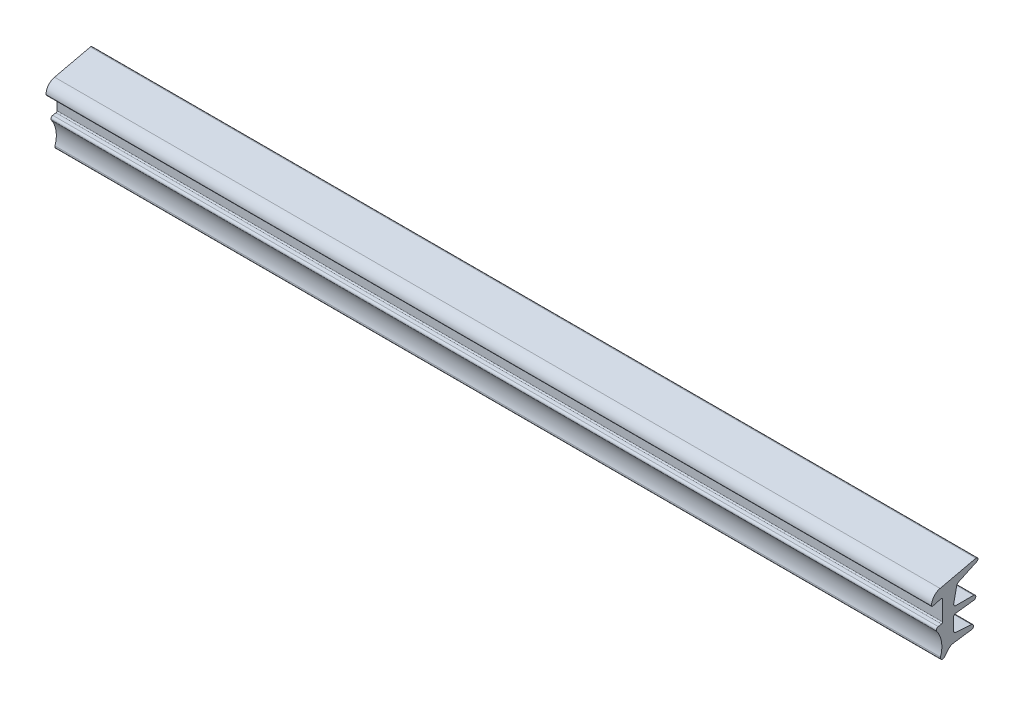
ISO-10303-21;
HEADER;
FILE_DESCRIPTION(('STEP AP214'),'2;1');
FILE_NAME('part.step','',(''),(''),'','','');
FILE_SCHEMA(('AUTOMOTIVE_DESIGN { 1 0 10303 214 1 1 1 1 }'));
ENDSEC;
DATA;
#1=APPLICATION_CONTEXT('core data for automotive mechanical design processes');
#2=APPLICATION_PROTOCOL_DEFINITION('international standard','automotive_design',2000,#1);
#3=PRODUCT_CONTEXT('',#1,'mechanical');
#4=PRODUCT('Part','Part','',(#3));
#5=PRODUCT_RELATED_PRODUCT_CATEGORY('part','',(#4));
#6=PRODUCT_DEFINITION_FORMATION('','',#4);
#7=PRODUCT_DEFINITION_CONTEXT('part definition',#1,'design');
#8=PRODUCT_DEFINITION('design','',#6,#7);
#9=PRODUCT_DEFINITION_SHAPE('','',#8);
#10=(LENGTH_UNIT() NAMED_UNIT(*) SI_UNIT(.MILLI.,.METRE.));
#11=(NAMED_UNIT(*) PLANE_ANGLE_UNIT() SI_UNIT($,.RADIAN.));
#12=(NAMED_UNIT(*) SI_UNIT($,.STERADIAN.) SOLID_ANGLE_UNIT());
#13=UNCERTAINTY_MEASURE_WITH_UNIT(LENGTH_MEASURE(1.E-05),#10,'distance_accuracy_value','');
#14=(GEOMETRIC_REPRESENTATION_CONTEXT(3) GLOBAL_UNCERTAINTY_ASSIGNED_CONTEXT((#13)) GLOBAL_UNIT_ASSIGNED_CONTEXT((#10,
#11,#12)) REPRESENTATION_CONTEXT('',''));
#15=CARTESIAN_POINT('',(0.,0.,0.));
#16=DIRECTION('',(0.,0.,1.));
#17=DIRECTION('',(1.,0.,0.));
#18=AXIS2_PLACEMENT_3D('',#15,#16,#17);
#19=CARTESIAN_POINT('',(200.,3.85279327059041,-2.80191835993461));
#20=DIRECTION('',(-1.,0.,0.));
#21=DIRECTION('',(0.,0.,1.));
#22=AXIS2_PLACEMENT_3D('',#19,#20,#21);
#23=CYLINDRICAL_SURFACE('',#22,1.00000000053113);
#24=CARTESIAN_POINT('',(0.,3.85279327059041,-2.80191835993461));
#25=DIRECTION('',(-1.,0.,0.));
#26=DIRECTION('',(0.,0.,-1.));
#27=AXIS2_PLACEMENT_3D('',#24,#25,#26);
#28=CIRCLE('',#27,1.00000000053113);
#29=CARTESIAN_POINT('',(0.,4.06070496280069,-1.8237707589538));
#30=VERTEX_POINT('',#29);
#31=CARTESIAN_POINT('',(0.,4.75910105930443,-2.37930010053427));
#32=VERTEX_POINT('',#31);
#33=EDGE_CURVE('E363',#30,#32,#28,.T.);
#34=ORIENTED_EDGE('',*,*,#33,.T.);
#35=DIRECTION('',(-1.,0.,0.));
#36=VECTOR('',#35,1.);
#37=CARTESIAN_POINT('',(200.,4.75910105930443,-2.37930010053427));
#38=LINE('',#37,#36);
#39=CARTESIAN_POINT('',(200.,4.75910105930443,-2.37930010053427));
#40=VERTEX_POINT('',#39);
#41=EDGE_CURVE('E12',#40,#32,#38,.T.);
#42=ORIENTED_EDGE('',*,*,#41,.F.);
#43=CARTESIAN_POINT('',(200.,3.85279327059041,-2.80191835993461));
#44=DIRECTION('',(-1.,0.,0.));
#45=DIRECTION('',(0.,0.,-1.));
#46=AXIS2_PLACEMENT_3D('',#43,#44,#45);
#47=CIRCLE('',#46,1.00000000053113);
#48=CARTESIAN_POINT('',(200.,4.06070496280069,-1.8237707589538));
#49=VERTEX_POINT('',#48);
#50=EDGE_CURVE('E448',#49,#40,#47,.T.);
#51=ORIENTED_EDGE('',*,*,#50,.F.);
#52=DIRECTION('',(-1.,0.,0.));
#53=VECTOR('',#52,1.);
#54=CARTESIAN_POINT('',(200.,4.06070496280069,-1.8237707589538));
#55=LINE('',#54,#53);
#56=EDGE_CURVE('E359',#49,#30,#55,.T.);
#57=ORIENTED_EDGE('',*,*,#56,.T.);
#58=EDGE_LOOP('',(#34,#42,#51,#57));
#59=FACE_BOUND('',#58,.T.);
#60=ADVANCED_FACE('F136',(#59),#23,.F.);
#61=CARTESIAN_POINT('',(200.,4.75910105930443,-2.37930010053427));
#62=DIRECTION('',(0.,0.906307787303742,0.422618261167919));
#63=DIRECTION('',(0.,-0.422618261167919,0.906307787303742));
#64=AXIS2_PLACEMENT_3D('',#61,#62,#63);
#65=PLANE('',#64);
#66=DIRECTION('',(0.,0.422618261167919,-0.906307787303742));
#67=VECTOR('',#66,1.);
#68=CARTESIAN_POINT('',(0.,4.75910105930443,-2.37930010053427));
#69=LINE('',#68,#67);
#70=CARTESIAN_POINT('',(0.,6.65024621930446,-6.43487399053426));
#71=VERTEX_POINT('',#70);
#72=EDGE_CURVE('E367',#32,#71,#69,.T.);
#73=ORIENTED_EDGE('',*,*,#72,.T.);
#74=DIRECTION('',(-1.,0.,0.));
#75=VECTOR('',#74,1.);
#76=CARTESIAN_POINT('',(200.,6.65024621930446,-6.43487399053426));
#77=LINE('',#76,#75);
#78=CARTESIAN_POINT('',(200.,6.65024621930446,-6.43487399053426));
#79=VERTEX_POINT('',#78);
#80=EDGE_CURVE('E145',#79,#71,#77,.T.);
#81=ORIENTED_EDGE('',*,*,#80,.F.);
#82=DIRECTION('',(0.,0.422618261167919,-0.906307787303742));
#83=VECTOR('',#82,1.);
#84=CARTESIAN_POINT('',(200.,4.75910105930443,-2.37930010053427));
#85=LINE('',#84,#83);
#86=EDGE_CURVE('E259',#40,#79,#85,.T.);
#87=ORIENTED_EDGE('',*,*,#86,.F.);
#88=ORIENTED_EDGE('',*,*,#41,.T.);
#89=EDGE_LOOP('',(#73,#81,#87,#88));
#90=FACE_BOUND('',#89,.T.);
#91=ADVANCED_FACE('F661',(#90),#65,.F.);
#92=CARTESIAN_POINT('',(200.,7.01276932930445,-6.26582669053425));
#93=DIRECTION('',(-1.,0.,0.));
#94=DIRECTION('',(0.,0.,1.));
#95=AXIS2_PLACEMENT_3D('',#92,#93,#94);
#96=CYLINDRICAL_SURFACE('',#95,0.399999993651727);
#97=CARTESIAN_POINT('',(0.,7.01276932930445,-6.26582669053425));
#98=DIRECTION('',(1.,0.,0.));
#99=DIRECTION('',(0.,0.,-1.));
#100=AXIS2_PLACEMENT_3D('',#97,#98,#99);
#101=CIRCLE('',#100,0.399999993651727);
#102=CARTESIAN_POINT('',(0.,7.40251734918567,-6.17584627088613));
#103=VERTEX_POINT('',#102);
#104=EDGE_CURVE('E370',#71,#103,#101,.T.);
#105=ORIENTED_EDGE('',*,*,#104,.T.);
#106=DIRECTION('',(-1.,0.,0.));
#107=VECTOR('',#106,1.);
#108=CARTESIAN_POINT('',(200.,7.40251734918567,-6.17584627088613));
#109=LINE('',#108,#107);
#110=CARTESIAN_POINT('',(200.,7.40251734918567,-6.17584627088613));
#111=VERTEX_POINT('',#110);
#112=EDGE_CURVE('E543',#111,#103,#109,.T.);
#113=ORIENTED_EDGE('',*,*,#112,.F.);
#114=CARTESIAN_POINT('',(200.,7.01276932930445,-6.26582669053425));
#115=DIRECTION('',(1.,0.,0.));
#116=DIRECTION('',(0.,0.,-1.));
#117=AXIS2_PLACEMENT_3D('',#114,#115,#116);
#118=CIRCLE('',#117,0.399999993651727);
#119=EDGE_CURVE('E553',#79,#111,#118,.T.);
#120=ORIENTED_EDGE('',*,*,#119,.F.);
#121=ORIENTED_EDGE('',*,*,#80,.T.);
#122=EDGE_LOOP('',(#105,#113,#120,#121));
#123=FACE_BOUND('',#122,.T.);
#124=ADVANCED_FACE('F551',(#123),#96,.T.);
#125=CARTESIAN_POINT('',(200.,7.4025173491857,-6.17584627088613));
#126=DIRECTION('',(0.,-0.97437006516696,-0.224951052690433));
#127=DIRECTION('',(0.,0.224951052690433,-0.97437006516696));
#128=AXIS2_PLACEMENT_3D('',#125,#126,#127);
#129=PLANE('',#128);
#130=DIRECTION('',(0.,-0.224951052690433,0.97437006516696));
#131=VECTOR('',#130,1.);
#132=CARTESIAN_POINT('',(0.,7.4025173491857,-6.17584627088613));
#133=LINE('',#132,#131);
#134=CARTESIAN_POINT('',(0.,5.5388576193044,1.89655094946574));
#135=VERTEX_POINT('',#134);
#136=EDGE_CURVE('E373',#103,#135,#133,.T.);
#137=ORIENTED_EDGE('',*,*,#136,.T.);
#138=DIRECTION('',(-1.,0.,0.));
#139=VECTOR('',#138,1.);
#140=CARTESIAN_POINT('',(200.,5.5388576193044,1.89655094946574));
#141=LINE('',#140,#139);
#142=CARTESIAN_POINT('',(200.,5.5388576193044,1.89655094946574));
#143=VERTEX_POINT('',#142);
#144=EDGE_CURVE('E539',#143,#135,#141,.T.);
#145=ORIENTED_EDGE('',*,*,#144,.F.);
#146=DIRECTION('',(0.,-0.224951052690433,0.97437006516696));
#147=VECTOR('',#146,1.);
#148=CARTESIAN_POINT('',(200.,7.4025173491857,-6.17584627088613));
#149=LINE('',#148,#147);
#150=EDGE_CURVE('E572',#111,#143,#149,.T.);
#151=ORIENTED_EDGE('',*,*,#150,.F.);
#152=ORIENTED_EDGE('',*,*,#112,.T.);
#153=EDGE_LOOP('',(#137,#145,#151,#152));
#154=FACE_BOUND('',#153,.T.);
#155=ADVANCED_FACE('F562',(#154),#129,.F.);
#156=CARTESIAN_POINT('',(200.,3.10293245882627,1.33417330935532));
#157=DIRECTION('',(-1.,0.,0.));
#158=DIRECTION('',(0.,0.,1.));
#159=AXIS2_PLACEMENT_3D('',#156,#157,#158);
#160=CYLINDRICAL_SURFACE('',#159,2.49999999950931);
#161=CARTESIAN_POINT('',(0.,3.10293245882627,1.33417330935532));
#162=DIRECTION('',(1.,0.,0.));
#163=DIRECTION('',(0.,0.,-1.));
#164=AXIS2_PLACEMENT_3D('',#161,#162,#163);
#165=CIRCLE('',#164,2.49999999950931);
#166=CARTESIAN_POINT('',(0.,3.10293245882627,3.83417330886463));
#167=VERTEX_POINT('',#166);
#168=EDGE_CURVE('E376',#135,#167,#165,.T.);
#169=ORIENTED_EDGE('',*,*,#168,.T.);
#170=DIRECTION('',(-1.,0.,0.));
#171=VECTOR('',#170,1.);
#172=CARTESIAN_POINT('',(200.,3.10293245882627,3.83417330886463));
#173=LINE('',#172,#171);
#174=CARTESIAN_POINT('',(200.,3.10293245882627,3.83417330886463));
#175=VERTEX_POINT('',#174);
#176=EDGE_CURVE('E535',#175,#167,#173,.T.);
#177=ORIENTED_EDGE('',*,*,#176,.F.);
#178=CARTESIAN_POINT('',(200.,3.10293245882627,1.33417330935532));
#179=DIRECTION('',(1.,0.,0.));
#180=DIRECTION('',(0.,0.,-1.));
#181=AXIS2_PLACEMENT_3D('',#178,#179,#180);
#182=CIRCLE('',#181,2.49999999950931);
#183=EDGE_CURVE('E568',#143,#175,#182,.T.);
#184=ORIENTED_EDGE('',*,*,#183,.F.);
#185=ORIENTED_EDGE('',*,*,#144,.T.);
#186=EDGE_LOOP('',(#169,#177,#184,#185));
#187=FACE_BOUND('',#186,.T.);
#188=ADVANCED_FACE('F566',(#187),#160,.T.);
#189=CARTESIAN_POINT('',(200.,3.10293245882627,3.83417330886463));
#190=DIRECTION('',(0.,0.,-1.));
#191=DIRECTION('',(-1.,0.,0.));
#192=AXIS2_PLACEMENT_3D('',#189,#190,#191);
#193=PLANE('',#192);
#194=DIRECTION('',(0.,-1.,0.));
#195=VECTOR('',#194,1.);
#196=CARTESIAN_POINT('',(0.,3.10293245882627,3.83417330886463));
#197=LINE('',#196,#195);
#198=CARTESIAN_POINT('',(0.,3.09450903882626,3.83417330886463));
#199=VERTEX_POINT('',#198);
#200=EDGE_CURVE('E379',#167,#199,#197,.T.);
#201=ORIENTED_EDGE('',*,*,#200,.T.);
#202=DIRECTION('',(-1.,0.,0.));
#203=VECTOR('',#202,1.);
#204=CARTESIAN_POINT('',(200.,3.09450903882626,3.83417330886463));
#205=LINE('',#204,#203);
#206=CARTESIAN_POINT('',(200.,3.09450903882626,3.83417330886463));
#207=VERTEX_POINT('',#206);
#208=EDGE_CURVE('E531',#207,#199,#205,.T.);
#209=ORIENTED_EDGE('',*,*,#208,.F.);
#210=DIRECTION('',(0.,-1.,0.));
#211=VECTOR('',#210,1.);
#212=CARTESIAN_POINT('',(200.,3.10293245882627,3.83417330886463));
#213=LINE('',#212,#211);
#214=EDGE_CURVE('E571',#175,#207,#213,.T.);
#215=ORIENTED_EDGE('',*,*,#214,.F.);
#216=ORIENTED_EDGE('',*,*,#176,.T.);
#217=EDGE_LOOP('',(#201,#209,#215,#216));
#218=FACE_BOUND('',#217,.T.);
#219=ADVANCED_FACE('F674',(#218),#193,.F.);
#220=CARTESIAN_POINT('',(200.,3.09450903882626,3.63417330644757));
#221=DIRECTION('',(-1.,0.,0.));
#222=DIRECTION('',(0.,0.,1.));
#223=AXIS2_PLACEMENT_3D('',#220,#221,#222);
#224=CYLINDRICAL_SURFACE('',#223,0.200000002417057);
#225=CARTESIAN_POINT('',(0.,3.09450903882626,3.63417330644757));
#226=DIRECTION('',(1.,0.,0.));
#227=DIRECTION('',(0.,0.,-1.));
#228=AXIS2_PLACEMENT_3D('',#225,#226,#227);
#229=CIRCLE('',#228,0.200000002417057);
#230=CARTESIAN_POINT('',(0.,2.90132387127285,3.58240949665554));
#231=VERTEX_POINT('',#230);
#232=EDGE_CURVE('E382',#199,#231,#229,.T.);
#233=ORIENTED_EDGE('',*,*,#232,.T.);
#234=DIRECTION('',(-1.,0.,0.));
#235=VECTOR('',#234,1.);
#236=CARTESIAN_POINT('',(200.,2.90132387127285,3.58240949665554));
#237=LINE('',#236,#235);
#238=CARTESIAN_POINT('',(200.,2.90132387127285,3.58240949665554));
#239=VERTEX_POINT('',#238);
#240=EDGE_CURVE('E527',#239,#231,#237,.T.);
#241=ORIENTED_EDGE('',*,*,#240,.F.);
#242=CARTESIAN_POINT('',(200.,3.09450903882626,3.63417330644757));
#243=DIRECTION('',(1.,0.,0.));
#244=DIRECTION('',(0.,0.,-1.));
#245=AXIS2_PLACEMENT_3D('',#242,#243,#244);
#246=CIRCLE('',#245,0.200000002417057);
#247=EDGE_CURVE('E576',#207,#239,#246,.T.);
#248=ORIENTED_EDGE('',*,*,#247,.F.);
#249=ORIENTED_EDGE('',*,*,#208,.T.);
#250=EDGE_LOOP('',(#233,#241,#248,#249));
#251=FACE_BOUND('',#250,.T.);
#252=ADVANCED_FACE('F677',(#251),#224,.T.);
#253=CARTESIAN_POINT('',(200.,2.90132387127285,3.58240949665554));
#254=DIRECTION('',(0.,0.965925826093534,0.258819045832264));
#255=DIRECTION('',(0.,-0.258819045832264,0.965925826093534));
#256=AXIS2_PLACEMENT_3D('',#253,#254,#255);
#257=PLANE('',#256);
#258=DIRECTION('',(0.,0.258819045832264,-0.965925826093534));
#259=VECTOR('',#258,1.);
#260=CARTESIAN_POINT('',(0.,2.90132387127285,3.58240949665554));
#261=LINE('',#260,#259);
#262=CARTESIAN_POINT('',(0.,3.40254708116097,1.71181901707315));
#263=VERTEX_POINT('',#262);
#264=EDGE_CURVE('E385',#231,#263,#261,.T.);
#265=ORIENTED_EDGE('',*,*,#264,.T.);
#266=DIRECTION('',(-1.,0.,0.));
#267=VECTOR('',#266,1.);
#268=CARTESIAN_POINT('',(200.,3.40254708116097,1.71181901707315));
#269=LINE('',#268,#267);
#270=CARTESIAN_POINT('',(200.,3.40254708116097,1.71181901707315));
#271=VERTEX_POINT('',#270);
#272=EDGE_CURVE('E523',#271,#263,#269,.T.);
#273=ORIENTED_EDGE('',*,*,#272,.F.);
#274=DIRECTION('',(0.,0.258819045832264,-0.965925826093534));
#275=VECTOR('',#274,1.);
#276=CARTESIAN_POINT('',(200.,2.90132387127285,3.58240949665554));
#277=LINE('',#276,#275);
#278=EDGE_CURVE('E583',#239,#271,#277,.T.);
#279=ORIENTED_EDGE('',*,*,#278,.F.);
#280=ORIENTED_EDGE('',*,*,#240,.T.);
#281=EDGE_LOOP('',(#265,#273,#279,#280));
#282=FACE_BOUND('',#281,.T.);
#283=ADVANCED_FACE('F681',(#282),#257,.F.);
#284=CARTESIAN_POINT('',(200.,3.11276933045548,1.63417331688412));
#285=DIRECTION('',(-1.,0.,0.));
#286=DIRECTION('',(0.,0.,1.));
#287=AXIS2_PLACEMENT_3D('',#284,#285,#286);
#288=CYLINDRICAL_SURFACE('',#287,0.299999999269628);
#289=CARTESIAN_POINT('',(0.,3.11276933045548,1.63417331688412));
#290=DIRECTION('',(-1.,0.,0.));
#291=DIRECTION('',(0.,0.,-1.));
#292=AXIS2_PLACEMENT_3D('',#289,#290,#291);
#293=CIRCLE('',#292,0.299999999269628);
#294=CARTESIAN_POINT('',(0.,3.11276933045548,1.33417331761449));
#295=VERTEX_POINT('',#294);
#296=EDGE_CURVE('E388',#263,#295,#293,.T.);
#297=ORIENTED_EDGE('',*,*,#296,.T.);
#298=DIRECTION('',(-1.,0.,0.));
#299=VECTOR('',#298,1.);
#300=CARTESIAN_POINT('',(200.,3.11276933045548,1.33417331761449));
#301=LINE('',#300,#299);
#302=CARTESIAN_POINT('',(200.,3.11276933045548,1.33417331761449));
#303=VERTEX_POINT('',#302);
#304=EDGE_CURVE('E519',#303,#295,#301,.T.);
#305=ORIENTED_EDGE('',*,*,#304,.F.);
#306=CARTESIAN_POINT('',(200.,3.11276933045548,1.63417331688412));
#307=DIRECTION('',(-1.,0.,0.));
#308=DIRECTION('',(0.,0.,-1.));
#309=AXIS2_PLACEMENT_3D('',#306,#307,#308);
#310=CIRCLE('',#309,0.299999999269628);
#311=EDGE_CURVE('E586',#271,#303,#310,.T.);
#312=ORIENTED_EDGE('',*,*,#311,.F.);
#313=ORIENTED_EDGE('',*,*,#272,.T.);
#314=EDGE_LOOP('',(#297,#305,#312,#313));
#315=FACE_BOUND('',#314,.T.);
#316=ADVANCED_FACE('F685',(#315),#288,.F.);
#317=CARTESIAN_POINT('',(200.,3.11276933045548,1.33417331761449));
#318=DIRECTION('',(0.,0.,-1.));
#319=DIRECTION('',(-1.,0.,0.));
#320=AXIS2_PLACEMENT_3D('',#317,#318,#319);
#321=PLANE('',#320);
#322=DIRECTION('',(0.,-1.,0.));
#323=VECTOR('',#322,1.);
#324=CARTESIAN_POINT('',(0.,3.11276933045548,1.33417331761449));
#325=LINE('',#324,#323);
#326=CARTESIAN_POINT('',(0.,-1.28723067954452,1.33417331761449));
#327=VERTEX_POINT('',#326);
#328=EDGE_CURVE('E391',#295,#327,#325,.T.);
#329=ORIENTED_EDGE('',*,*,#328,.T.);
#330=DIRECTION('',(-1.,0.,0.));
#331=VECTOR('',#330,1.);
#332=CARTESIAN_POINT('',(200.,-1.28723067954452,1.33417331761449));
#333=LINE('',#332,#331);
#334=CARTESIAN_POINT('',(200.,-1.28723067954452,1.33417331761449));
#335=VERTEX_POINT('',#334);
#336=EDGE_CURVE('E515',#335,#327,#333,.T.);
#337=ORIENTED_EDGE('',*,*,#336,.F.);
#338=DIRECTION('',(0.,-1.,0.));
#339=VECTOR('',#338,1.);
#340=CARTESIAN_POINT('',(200.,3.11276933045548,1.33417331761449));
#341=LINE('',#340,#339);
#342=EDGE_CURVE('E589',#303,#335,#341,.T.);
#343=ORIENTED_EDGE('',*,*,#342,.F.);
#344=ORIENTED_EDGE('',*,*,#304,.T.);
#345=EDGE_LOOP('',(#329,#337,#343,#344));
#346=FACE_BOUND('',#345,.T.);
#347=ADVANCED_FACE('F689',(#346),#321,.F.);
#348=CARTESIAN_POINT('',(200.,-1.28723067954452,1.63417331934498));
#349=DIRECTION('',(-1.,0.,0.));
#350=DIRECTION('',(0.,0.,1.));
#351=AXIS2_PLACEMENT_3D('',#348,#349,#350);
#352=CYLINDRICAL_SURFACE('',#351,0.300000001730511);
#353=CARTESIAN_POINT('',(0.,-1.28723067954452,1.63417331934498));
#354=DIRECTION('',(-1.,0.,0.));
#355=DIRECTION('',(0.,0.,-1.));
#356=AXIS2_PLACEMENT_3D('',#353,#354,#355);
#357=CIRCLE('',#356,0.300000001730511);
#358=CARTESIAN_POINT('',(0.,-1.58267300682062,1.58207886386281));
#359=VERTEX_POINT('',#358);
#360=EDGE_CURVE('E394',#327,#359,#357,.T.);
#361=ORIENTED_EDGE('',*,*,#360,.T.);
#362=DIRECTION('',(-1.,0.,0.));
#363=VECTOR('',#362,1.);
#364=CARTESIAN_POINT('',(200.,-1.58267300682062,1.58207886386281));
#365=LINE('',#364,#363);
#366=CARTESIAN_POINT('',(200.,-1.58267300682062,1.58207886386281));
#367=VERTEX_POINT('',#366);
#368=EDGE_CURVE('E511',#367,#359,#365,.T.);
#369=ORIENTED_EDGE('',*,*,#368,.F.);
#370=CARTESIAN_POINT('',(200.,-1.28723067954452,1.63417331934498));
#371=DIRECTION('',(-1.,0.,0.));
#372=DIRECTION('',(0.,0.,-1.));
#373=AXIS2_PLACEMENT_3D('',#370,#371,#372);
#374=CIRCLE('',#373,0.300000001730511);
#375=EDGE_CURVE('E592',#335,#367,#374,.T.);
#376=ORIENTED_EDGE('',*,*,#375,.F.);
#377=ORIENTED_EDGE('',*,*,#336,.T.);
#378=EDGE_LOOP('',(#361,#369,#376,#377));
#379=FACE_BOUND('',#378,.T.);
#380=ADVANCED_FACE('F693',(#379),#352,.F.);
#381=CARTESIAN_POINT('',(200.,-1.58267300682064,1.58207886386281));
#382=DIRECTION('',(0.,-0.984807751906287,-0.173648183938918));
#383=DIRECTION('',(0.,0.173648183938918,-0.984807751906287));
#384=AXIS2_PLACEMENT_3D('',#381,#382,#383);
#385=PLANE('',#384);
#386=DIRECTION('',(0.,-0.173648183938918,0.984807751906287));
#387=VECTOR('',#386,1.);
#388=CARTESIAN_POINT('',(0.,-1.58267300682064,1.58207886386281));
#389=LINE('',#388,#387);
#390=CARTESIAN_POINT('',(0.,-1.71296428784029,2.32099740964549));
#391=VERTEX_POINT('',#390);
#392=EDGE_CURVE('E397',#359,#391,#389,.T.);
#393=ORIENTED_EDGE('',*,*,#392,.T.);
#394=DIRECTION('',(-1.,0.,0.));
#395=VECTOR('',#394,1.);
#396=CARTESIAN_POINT('',(200.,-1.71296428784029,2.32099740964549));
#397=LINE('',#396,#395);
#398=CARTESIAN_POINT('',(200.,-1.71296428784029,2.32099740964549));
#399=VERTEX_POINT('',#398);
#400=EDGE_CURVE('E507',#399,#391,#397,.T.);
#401=ORIENTED_EDGE('',*,*,#400,.F.);
#402=DIRECTION('',(0.,-0.173648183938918,0.984807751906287));
#403=VECTOR('',#402,1.);
#404=CARTESIAN_POINT('',(200.,-1.58267300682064,1.58207886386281));
#405=LINE('',#404,#403);
#406=EDGE_CURVE('E595',#367,#399,#405,.T.);
#407=ORIENTED_EDGE('',*,*,#406,.F.);
#408=ORIENTED_EDGE('',*,*,#368,.T.);
#409=EDGE_LOOP('',(#393,#401,#407,#408));
#410=FACE_BOUND('',#409,.T.);
#411=ADVANCED_FACE('F697',(#410),#385,.F.);
#412=CARTESIAN_POINT('',(200.,-2.20536816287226,2.23417332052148));
#413=DIRECTION('',(-1.,0.,0.));
#414=DIRECTION('',(0.,0.,1.));
#415=AXIS2_PLACEMENT_3D('',#412,#413,#414);
#416=CYLINDRICAL_SURFACE('',#415,0.499999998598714);
#417=CARTESIAN_POINT('',(0.,-2.20536816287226,2.23417332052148));
#418=DIRECTION('',(1.,0.,0.));
#419=DIRECTION('',(0.,0.,-1.));
#420=AXIS2_PLACEMENT_3D('',#417,#418,#419);
#421=CIRCLE('',#420,0.499999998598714);
#422=CARTESIAN_POINT('',(0.,-2.49215636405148,2.64374935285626));
#423=VERTEX_POINT('',#422);
#424=EDGE_CURVE('E400',#391,#423,#421,.T.);
#425=ORIENTED_EDGE('',*,*,#424,.T.);
#426=DIRECTION('',(-1.,0.,0.));
#427=VECTOR('',#426,1.);
#428=CARTESIAN_POINT('',(200.,-2.49215636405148,2.64374935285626));
#429=LINE('',#428,#427);
#430=CARTESIAN_POINT('',(200.,-2.49215636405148,2.64374935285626));
#431=VERTEX_POINT('',#430);
#432=EDGE_CURVE('E503',#431,#423,#429,.T.);
#433=ORIENTED_EDGE('',*,*,#432,.F.);
#434=CARTESIAN_POINT('',(200.,-2.20536816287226,2.23417332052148));
#435=DIRECTION('',(1.,0.,0.));
#436=DIRECTION('',(0.,0.,-1.));
#437=AXIS2_PLACEMENT_3D('',#434,#435,#436);
#438=CIRCLE('',#437,0.499999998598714);
#439=EDGE_CURVE('E598',#399,#431,#438,.T.);
#440=ORIENTED_EDGE('',*,*,#439,.F.);
#441=ORIENTED_EDGE('',*,*,#400,.T.);
#442=EDGE_LOOP('',(#425,#433,#440,#441));
#443=FACE_BOUND('',#442,.T.);
#444=ADVANCED_FACE('F701',(#443),#416,.T.);
#445=CARTESIAN_POINT('',(200.,-2.49215636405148,2.64374935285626));
#446=DIRECTION('',(0.,0.573576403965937,-0.819152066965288));
#447=DIRECTION('',(0.,0.819152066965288,0.573576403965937));
#448=AXIS2_PLACEMENT_3D('',#445,#446,#447);
#449=PLANE('',#448);
#450=DIRECTION('',(0.,-0.819152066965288,-0.573576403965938));
#451=VECTOR('',#450,1.);
#452=CARTESIAN_POINT('',(0.,-2.49215636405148,2.64374935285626));
#453=LINE('',#452,#451);
#454=CARTESIAN_POINT('',(0.,-2.57784203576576,2.58375160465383));
#455=VERTEX_POINT('',#454);
#456=EDGE_CURVE('E403',#423,#455,#453,.T.);
#457=ORIENTED_EDGE('',*,*,#456,.T.);
#458=DIRECTION('',(-1.,0.,0.));
#459=VECTOR('',#458,1.);
#460=CARTESIAN_POINT('',(200.,-2.57784203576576,2.58375160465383));
#461=LINE('',#460,#459);
#462=CARTESIAN_POINT('',(200.,-2.57784203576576,2.58375160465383));
#463=VERTEX_POINT('',#462);
#464=EDGE_CURVE('E499',#463,#455,#461,.T.);
#465=ORIENTED_EDGE('',*,*,#464,.F.);
#466=DIRECTION('',(0.,-0.819152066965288,-0.573576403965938));
#467=VECTOR('',#466,1.);
#468=CARTESIAN_POINT('',(200.,-2.49215636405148,2.64374935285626));
#469=LINE('',#468,#467);
#470=EDGE_CURVE('E601',#431,#463,#469,.T.);
#471=ORIENTED_EDGE('',*,*,#470,.F.);
#472=ORIENTED_EDGE('',*,*,#432,.T.);
#473=EDGE_LOOP('',(#457,#465,#471,#472));
#474=FACE_BOUND('',#473,.T.);
#475=ADVANCED_FACE('F705',(#474),#449,.F.);
#476=CARTESIAN_POINT('',(200.,-6.01930066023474,7.49866387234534));
#477=DIRECTION('',(-1.,0.,0.));
#478=DIRECTION('',(0.,0.,1.));
#479=AXIS2_PLACEMENT_3D('',#476,#477,#478);
#480=CYLINDRICAL_SURFACE('',#479,6.00000000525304);
#481=CARTESIAN_POINT('',(0.,-6.01930066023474,7.49866387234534));
#482=DIRECTION('',(-1.,0.,0.));
#483=DIRECTION('',(0.,0.,-1.));
#484=AXIS2_PLACEMENT_3D('',#481,#482,#483);
#485=CIRCLE('',#484,6.00000000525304);
#486=CARTESIAN_POINT('',(0.,-7.92810781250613,1.81039038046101));
#487=VERTEX_POINT('',#486);
#488=EDGE_CURVE('E406',#455,#487,#485,.T.);
#489=ORIENTED_EDGE('',*,*,#488,.T.);
#490=DIRECTION('',(-1.,0.,0.));
#491=VECTOR('',#490,1.);
#492=CARTESIAN_POINT('',(200.,-7.92810781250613,1.81039038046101));
#493=LINE('',#492,#491);
#494=CARTESIAN_POINT('',(200.,-7.92810781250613,1.81039038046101));
#495=VERTEX_POINT('',#494);
#496=EDGE_CURVE('E495',#495,#487,#493,.T.);
#497=ORIENTED_EDGE('',*,*,#496,.F.);
#498=CARTESIAN_POINT('',(200.,-6.01930066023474,7.49866387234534));
#499=DIRECTION('',(-1.,0.,0.));
#500=DIRECTION('',(0.,0.,-1.));
#501=AXIS2_PLACEMENT_3D('',#498,#499,#500);
#502=CIRCLE('',#501,6.00000000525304);
#503=EDGE_CURVE('E604',#463,#495,#502,.T.);
#504=ORIENTED_EDGE('',*,*,#503,.F.);
#505=ORIENTED_EDGE('',*,*,#464,.T.);
#506=EDGE_LOOP('',(#489,#497,#504,#505));
#507=FACE_BOUND('',#506,.T.);
#508=ADVANCED_FACE('F709',(#507),#480,.F.);
#509=CARTESIAN_POINT('',(200.,-8.08723068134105,1.33638625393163));
#510=DIRECTION('',(-1.,0.,0.));
#511=DIRECTION('',(0.,0.,1.));
#512=AXIS2_PLACEMENT_3D('',#509,#510,#511);
#513=CYLINDRICAL_SURFACE('',#512,0.499999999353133);
#514=CARTESIAN_POINT('',(0.,-8.08723068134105,1.33638625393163));
#515=DIRECTION('',(1.,0.,0.));
#516=DIRECTION('',(0.,0.,-1.));
#517=AXIS2_PLACEMENT_3D('',#514,#515,#516);
#518=CIRCLE('',#517,0.499999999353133);
#519=CARTESIAN_POINT('',(0.,-8.40862448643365,0.953364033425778));
#520=VERTEX_POINT('',#519);
#521=EDGE_CURVE('E409',#487,#520,#518,.T.);
#522=ORIENTED_EDGE('',*,*,#521,.T.);
#523=DIRECTION('',(-1.,0.,0.));
#524=VECTOR('',#523,1.);
#525=CARTESIAN_POINT('',(200.,-8.40862448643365,0.953364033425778));
#526=LINE('',#525,#524);
#527=CARTESIAN_POINT('',(200.,-8.40862448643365,0.953364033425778));
#528=VERTEX_POINT('',#527);
#529=EDGE_CURVE('E491',#528,#520,#526,.T.);
#530=ORIENTED_EDGE('',*,*,#529,.F.);
#531=CARTESIAN_POINT('',(200.,-8.08723068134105,1.33638625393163));
#532=DIRECTION('',(1.,0.,0.));
#533=DIRECTION('',(0.,0.,-1.));
#534=AXIS2_PLACEMENT_3D('',#531,#532,#533);
#535=CIRCLE('',#534,0.499999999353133);
#536=EDGE_CURVE('E607',#495,#528,#535,.T.);
#537=ORIENTED_EDGE('',*,*,#536,.F.);
#538=ORIENTED_EDGE('',*,*,#496,.T.);
#539=EDGE_LOOP('',(#522,#530,#537,#538));
#540=FACE_BOUND('',#539,.T.);
#541=ADVANCED_FACE('F713',(#540),#513,.T.);
#542=CARTESIAN_POINT('',(200.,-8.40862448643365,0.953364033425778));
#543=DIRECTION('',(0.,0.642787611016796,0.766044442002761));
#544=DIRECTION('',(0.,-0.76604444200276,0.642787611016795));
#545=AXIS2_PLACEMENT_3D('',#542,#543,#544);
#546=PLANE('',#545);
#547=DIRECTION('',(0.,0.766044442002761,-0.642787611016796));
#548=VECTOR('',#547,1.);
#549=CARTESIAN_POINT('',(0.,-8.40862448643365,0.953364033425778));
#550=LINE('',#549,#548);
#551=CARTESIAN_POINT('',(0.,-7.34553131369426,0.0613229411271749));
#552=VERTEX_POINT('',#551);
#553=EDGE_CURVE('E412',#520,#552,#550,.T.);
#554=ORIENTED_EDGE('',*,*,#553,.T.);
#555=DIRECTION('',(-1.,0.,0.));
#556=VECTOR('',#555,1.);
#557=CARTESIAN_POINT('',(200.,-7.34553131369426,0.0613229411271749));
#558=LINE('',#557,#556);
#559=CARTESIAN_POINT('',(200.,-7.34553131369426,0.0613229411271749));
#560=VERTEX_POINT('',#559);
#561=EDGE_CURVE('E487',#560,#552,#558,.T.);
#562=ORIENTED_EDGE('',*,*,#561,.F.);
#563=DIRECTION('',(0.,0.766044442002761,-0.642787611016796));
#564=VECTOR('',#563,1.);
#565=CARTESIAN_POINT('',(200.,-8.40862448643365,0.953364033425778));
#566=LINE('',#565,#564);
#567=EDGE_CURVE('E610',#528,#560,#566,.T.);
#568=ORIENTED_EDGE('',*,*,#567,.F.);
#569=ORIENTED_EDGE('',*,*,#529,.T.);
#570=EDGE_LOOP('',(#554,#562,#568,#569));
#571=FACE_BOUND('',#570,.T.);
#572=ADVANCED_FACE('F717',(#571),#546,.F.);
#573=CARTESIAN_POINT('',(200.,-8.63110656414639,-1.47076591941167));
#574=DIRECTION('',(-1.,0.,0.));
#575=DIRECTION('',(0.,0.,1.));
#576=AXIS2_PLACEMENT_3D('',#573,#574,#575);
#577=CYLINDRICAL_SURFACE('',#576,2.00000000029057);
#578=CARTESIAN_POINT('',(0.,-8.63110656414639,-1.47076591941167));
#579=DIRECTION('',(-1.,0.,0.));
#580=DIRECTION('',(0.,0.,-1.));
#581=AXIS2_PLACEMENT_3D('',#578,#579,#580);
#582=CIRCLE('',#581,2.00000000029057);
#583=CARTESIAN_POINT('',(0.,-6.65057042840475,-1.19241970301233));
#584=VERTEX_POINT('',#583);
#585=EDGE_CURVE('E415',#552,#584,#582,.T.);
#586=ORIENTED_EDGE('',*,*,#585,.T.);
#587=DIRECTION('',(-1.,0.,0.));
#588=VECTOR('',#587,1.);
#589=CARTESIAN_POINT('',(200.,-6.65057042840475,-1.19241970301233));
#590=LINE('',#589,#588);
#591=CARTESIAN_POINT('',(200.,-6.65057042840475,-1.19241970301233));
#592=VERTEX_POINT('',#591);
#593=EDGE_CURVE('E483',#592,#584,#590,.T.);
#594=ORIENTED_EDGE('',*,*,#593,.F.);
#595=CARTESIAN_POINT('',(200.,-8.63110656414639,-1.47076591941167));
#596=DIRECTION('',(-1.,0.,0.));
#597=DIRECTION('',(0.,0.,-1.));
#598=AXIS2_PLACEMENT_3D('',#595,#596,#597);
#599=CIRCLE('',#598,2.00000000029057);
#600=EDGE_CURVE('E613',#560,#592,#599,.T.);
#601=ORIENTED_EDGE('',*,*,#600,.F.);
#602=ORIENTED_EDGE('',*,*,#561,.T.);
#603=EDGE_LOOP('',(#586,#594,#601,#602));
#604=FACE_BOUND('',#603,.T.);
#605=ADVANCED_FACE('F721',(#604),#577,.F.);
#606=CARTESIAN_POINT('',(200.,-6.65057042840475,-1.19241970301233));
#607=DIRECTION('',(0.,0.990268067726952,0.139173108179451));
#608=DIRECTION('',(0.,-0.139173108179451,0.990268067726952));
#609=AXIS2_PLACEMENT_3D('',#606,#607,#608);
#610=PLANE('',#609);
#611=DIRECTION('',(0.,0.139173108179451,-0.990268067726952));
#612=VECTOR('',#611,1.);
#613=CARTESIAN_POINT('',(0.,-6.65057042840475,-1.19241970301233));
#614=LINE('',#613,#612);
#615=CARTESIAN_POINT('',(0.,-6.08236471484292,-5.23541321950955));
#616=VERTEX_POINT('',#615);
#617=EDGE_CURVE('E418',#584,#616,#614,.T.);
#618=ORIENTED_EDGE('',*,*,#617,.T.);
#619=DIRECTION('',(-1.,0.,0.));
#620=VECTOR('',#619,1.);
#621=CARTESIAN_POINT('',(200.,-6.08236471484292,-5.23541321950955));
#622=LINE('',#621,#620);
#623=CARTESIAN_POINT('',(200.,-6.08236471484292,-5.23541321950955));
#624=VERTEX_POINT('',#623);
#625=EDGE_CURVE('E479',#624,#616,#622,.T.);
#626=ORIENTED_EDGE('',*,*,#625,.F.);
#627=DIRECTION('',(0.,0.139173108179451,-0.990268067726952));
#628=VECTOR('',#627,1.);
#629=CARTESIAN_POINT('',(200.,-6.65057042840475,-1.19241970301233));
#630=LINE('',#629,#628);
#631=EDGE_CURVE('E616',#592,#624,#630,.T.);
#632=ORIENTED_EDGE('',*,*,#631,.F.);
#633=ORIENTED_EDGE('',*,*,#593,.T.);
#634=EDGE_LOOP('',(#618,#626,#632,#633));
#635=FACE_BOUND('',#634,.T.);
#636=ADVANCED_FACE('F725',(#635),#610,.F.);
#637=CARTESIAN_POINT('',(200.,-5.58723068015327,-5.16582666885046));
#638=DIRECTION('',(-1.,0.,0.));
#639=DIRECTION('',(0.,0.,1.));
#640=AXIS2_PLACEMENT_3D('',#637,#638,#639);
#641=CYLINDRICAL_SURFACE('',#640,0.500000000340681);
#642=CARTESIAN_POINT('',(0.,-5.58723068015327,-5.16582666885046));
#643=DIRECTION('',(1.,0.,0.));
#644=DIRECTION('',(0.,0.,-1.));
#645=AXIS2_PLACEMENT_3D('',#642,#643,#644);
#646=CIRCLE('',#645,0.500000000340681);
#647=CARTESIAN_POINT('',(0.,-5.08844865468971,-5.20070490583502));
#648=VERTEX_POINT('',#647);
#649=EDGE_CURVE('E421',#616,#648,#646,.T.);
#650=ORIENTED_EDGE('',*,*,#649,.T.);
#651=DIRECTION('',(-1.,0.,0.));
#652=VECTOR('',#651,1.);
#653=CARTESIAN_POINT('',(200.,-5.08844865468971,-5.20070490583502));
#654=LINE('',#653,#652);
#655=CARTESIAN_POINT('',(200.,-5.08844865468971,-5.20070490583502));
#656=VERTEX_POINT('',#655);
#657=EDGE_CURVE('E475',#656,#648,#654,.T.);
#658=ORIENTED_EDGE('',*,*,#657,.F.);
#659=CARTESIAN_POINT('',(200.,-5.58723068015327,-5.16582666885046));
#660=DIRECTION('',(1.,0.,0.));
#661=DIRECTION('',(0.,0.,-1.));
#662=AXIS2_PLACEMENT_3D('',#659,#660,#661);
#663=CIRCLE('',#662,0.500000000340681);
#664=EDGE_CURVE('E619',#624,#656,#663,.T.);
#665=ORIENTED_EDGE('',*,*,#664,.F.);
#666=ORIENTED_EDGE('',*,*,#625,.T.);
#667=EDGE_LOOP('',(#650,#658,#665,#666));
#668=FACE_BOUND('',#667,.T.);
#669=ADVANCED_FACE('F729',(#668),#641,.T.);
#670=CARTESIAN_POINT('',(200.,-5.08844865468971,-5.20070490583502));
#671=DIRECTION('',(0.,-0.997564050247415,0.0697564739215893));
#672=DIRECTION('',(0.,-0.0697564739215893,-0.997564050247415));
#673=AXIS2_PLACEMENT_3D('',#670,#671,#672);
#674=PLANE('',#673);
#675=DIRECTION('',(0.,0.0697564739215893,0.997564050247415));
#676=VECTOR('',#675,1.);
#677=CARTESIAN_POINT('',(0.,-5.08844865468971,-5.20070490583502));
#678=LINE('',#677,#676);
#679=CARTESIAN_POINT('',(0.,-4.83882696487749,-1.6309484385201));
#680=VERTEX_POINT('',#679);
#681=EDGE_CURVE('E424',#648,#680,#678,.T.);
#682=ORIENTED_EDGE('',*,*,#681,.T.);
#683=DIRECTION('',(-1.,0.,0.));
#684=VECTOR('',#683,1.);
#685=CARTESIAN_POINT('',(200.,-4.83882696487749,-1.6309484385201));
#686=LINE('',#685,#684);
#687=CARTESIAN_POINT('',(200.,-4.83882696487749,-1.6309484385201));
#688=VERTEX_POINT('',#687);
#689=EDGE_CURVE('E471',#688,#680,#686,.T.);
#690=ORIENTED_EDGE('',*,*,#689,.F.);
#691=DIRECTION('',(0.,0.0697564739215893,0.997564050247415));
#692=VECTOR('',#691,1.);
#693=CARTESIAN_POINT('',(200.,-5.08844865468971,-5.20070490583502));
#694=LINE('',#693,#692);
#695=EDGE_CURVE('E622',#656,#688,#694,.T.);
#696=ORIENTED_EDGE('',*,*,#695,.F.);
#697=ORIENTED_EDGE('',*,*,#657,.T.);
#698=EDGE_LOOP('',(#682,#690,#696,#697));
#699=FACE_BOUND('',#698,.T.);
#700=ADVANCED_FACE('F733',(#699),#674,.F.);
#701=CARTESIAN_POINT('',(200.,-4.34004493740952,-1.66582667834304));
#702=DIRECTION('',(-1.,0.,0.));
#703=DIRECTION('',(0.,0.,1.));
#704=AXIS2_PLACEMENT_3D('',#701,#702,#703);
#705=CYLINDRICAL_SURFACE('',#704,0.50000000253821);
#706=CARTESIAN_POINT('',(0.,-4.34004493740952,-1.66582667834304));
#707=DIRECTION('',(-1.,0.,0.));
#708=DIRECTION('',(0.,0.,-1.));
#709=AXIS2_PLACEMENT_3D('',#706,#707,#708);
#710=CIRCLE('',#709,0.50000000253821);
#711=CARTESIAN_POINT('',(0.,-4.34004493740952,-1.16582667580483));
#712=VERTEX_POINT('',#711);
#713=EDGE_CURVE('E427',#680,#712,#710,.T.);
#714=ORIENTED_EDGE('',*,*,#713,.T.);
#715=DIRECTION('',(-1.,0.,0.));
#716=VECTOR('',#715,1.);
#717=CARTESIAN_POINT('',(200.,-4.34004493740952,-1.16582667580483));
#718=LINE('',#717,#716);
#719=CARTESIAN_POINT('',(200.,-4.34004493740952,-1.16582667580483));
#720=VERTEX_POINT('',#719);
#721=EDGE_CURVE('E467',#720,#712,#718,.T.);
#722=ORIENTED_EDGE('',*,*,#721,.F.);
#723=CARTESIAN_POINT('',(200.,-4.34004493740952,-1.66582667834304));
#724=DIRECTION('',(-1.,0.,0.));
#725=DIRECTION('',(0.,0.,-1.));
#726=AXIS2_PLACEMENT_3D('',#723,#724,#725);
#727=CIRCLE('',#726,0.50000000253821);
#728=EDGE_CURVE('E625',#688,#720,#727,.T.);
#729=ORIENTED_EDGE('',*,*,#728,.F.);
#730=ORIENTED_EDGE('',*,*,#689,.T.);
#731=EDGE_LOOP('',(#714,#722,#729,#730));
#732=FACE_BOUND('',#731,.T.);
#733=ADVANCED_FACE('F737',(#732),#705,.F.);
#734=CARTESIAN_POINT('',(200.,-4.34004493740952,-1.16582667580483));
#735=DIRECTION('',(0.,0.,1.));
#736=DIRECTION('',(1.,0.,0.));
#737=AXIS2_PLACEMENT_3D('',#734,#735,#736);
#738=PLANE('',#737);
#739=DIRECTION('',(0.,1.,0.));
#740=VECTOR('',#739,1.);
#741=CARTESIAN_POINT('',(0.,-4.34004493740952,-1.16582667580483));
#742=LINE('',#741,#740);
#743=CARTESIAN_POINT('',(0.,-1.58587874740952,-1.16582667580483));
#744=VERTEX_POINT('',#743);
#745=EDGE_CURVE('E430',#712,#744,#742,.T.);
#746=ORIENTED_EDGE('',*,*,#745,.T.);
#747=DIRECTION('',(-1.,0.,0.));
#748=VECTOR('',#747,1.);
#749=CARTESIAN_POINT('',(200.,-1.58587874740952,-1.16582667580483));
#750=LINE('',#749,#748);
#751=CARTESIAN_POINT('',(200.,-1.58587874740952,-1.16582667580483));
#752=VERTEX_POINT('',#751);
#753=EDGE_CURVE('E463',#752,#744,#750,.T.);
#754=ORIENTED_EDGE('',*,*,#753,.F.);
#755=DIRECTION('',(0.,1.,0.));
#756=VECTOR('',#755,1.);
#757=CARTESIAN_POINT('',(200.,-4.34004493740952,-1.16582667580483));
#758=LINE('',#757,#756);
#759=EDGE_CURVE('E628',#720,#752,#758,.T.);
#760=ORIENTED_EDGE('',*,*,#759,.F.);
#761=ORIENTED_EDGE('',*,*,#721,.T.);
#762=EDGE_LOOP('',(#746,#754,#760,#761));
#763=FACE_BOUND('',#762,.T.);
#764=ADVANCED_FACE('F741',(#763),#738,.F.);
#765=CARTESIAN_POINT('',(200.,-1.58587874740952,-1.66582667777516));
#766=DIRECTION('',(-1.,0.,0.));
#767=DIRECTION('',(0.,0.,1.));
#768=AXIS2_PLACEMENT_3D('',#765,#766,#767);
#769=CYLINDRICAL_SURFACE('',#768,0.500000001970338);
#770=CARTESIAN_POINT('',(0.,-1.58587874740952,-1.66582667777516));
#771=DIRECTION('',(-1.,0.,0.));
#772=DIRECTION('',(0.,0.,-1.));
#773=AXIS2_PLACEMENT_3D('',#770,#771,#772);
#774=CIRCLE('',#773,0.500000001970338);
#775=CARTESIAN_POINT('',(0.,-1.08960566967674,-1.60489200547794));
#776=VERTEX_POINT('',#775);
#777=EDGE_CURVE('E433',#744,#776,#774,.T.);
#778=ORIENTED_EDGE('',*,*,#777,.T.);
#779=DIRECTION('',(-1.,0.,0.));
#780=VECTOR('',#779,1.);
#781=CARTESIAN_POINT('',(200.,-1.08960566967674,-1.60489200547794));
#782=LINE('',#781,#780);
#783=CARTESIAN_POINT('',(200.,-1.08960566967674,-1.60489200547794));
#784=VERTEX_POINT('',#783);
#785=EDGE_CURVE('E459',#784,#776,#782,.T.);
#786=ORIENTED_EDGE('',*,*,#785,.F.);
#787=CARTESIAN_POINT('',(200.,-1.58587874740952,-1.66582667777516));
#788=DIRECTION('',(-1.,0.,0.));
#789=DIRECTION('',(0.,0.,-1.));
#790=AXIS2_PLACEMENT_3D('',#787,#788,#789);
#791=CIRCLE('',#790,0.500000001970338);
#792=EDGE_CURVE('E631',#752,#784,#791,.T.);
#793=ORIENTED_EDGE('',*,*,#792,.F.);
#794=ORIENTED_EDGE('',*,*,#753,.T.);
#795=EDGE_LOOP('',(#778,#786,#793,#794));
#796=FACE_BOUND('',#795,.T.);
#797=ADVANCED_FACE('F745',(#796),#769,.F.);
#798=CARTESIAN_POINT('',(200.,-1.08960566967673,-1.60489200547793));
#799=DIRECTION('',(0.,0.992546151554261,0.121869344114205));
#800=DIRECTION('',(0.,-0.121869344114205,0.992546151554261));
#801=AXIS2_PLACEMENT_3D('',#798,#799,#800);
#802=PLANE('',#801);
#803=DIRECTION('',(0.,0.121869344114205,-0.992546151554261));
#804=VECTOR('',#803,1.);
#805=CARTESIAN_POINT('',(0.,-1.08960566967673,-1.60489200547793));
#806=LINE('',#805,#804);
#807=CARTESIAN_POINT('',(0.,-0.583503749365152,-5.72676134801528));
#808=VERTEX_POINT('',#807);
#809=EDGE_CURVE('E436',#776,#808,#806,.T.);
#810=ORIENTED_EDGE('',*,*,#809,.T.);
#811=DIRECTION('',(-1.,0.,0.));
#812=VECTOR('',#811,1.);
#813=CARTESIAN_POINT('',(200.,-0.583503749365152,-5.72676134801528));
#814=LINE('',#813,#812);
#815=CARTESIAN_POINT('',(200.,-0.583503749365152,-5.72676134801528));
#816=VERTEX_POINT('',#815);
#817=EDGE_CURVE('E455',#816,#808,#814,.T.);
#818=ORIENTED_EDGE('',*,*,#817,.F.);
#819=DIRECTION('',(0.,0.121869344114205,-0.992546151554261));
#820=VECTOR('',#819,1.);
#821=CARTESIAN_POINT('',(200.,-1.08960566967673,-1.60489200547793));
#822=LINE('',#821,#820);
#823=EDGE_CURVE('E634',#784,#816,#822,.T.);
#824=ORIENTED_EDGE('',*,*,#823,.F.);
#825=ORIENTED_EDGE('',*,*,#785,.T.);
#826=EDGE_LOOP('',(#810,#818,#824,#825));
#827=FACE_BOUND('',#826,.T.);
#828=ADVANCED_FACE('F642',(#827),#802,.F.);
#829=CARTESIAN_POINT('',(200.,-0.0872306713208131,-5.6658266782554));
#830=DIRECTION('',(-1.,0.,0.));
#831=DIRECTION('',(0.,0.,1.));
#832=AXIS2_PLACEMENT_3D('',#829,#830,#831);
#833=CYLINDRICAL_SURFACE('',#832,0.500000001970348);
#834=CARTESIAN_POINT('',(0.,-0.0872306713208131,-5.6658266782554));
#835=DIRECTION('',(1.,0.,0.));
#836=DIRECTION('',(0.,0.,-1.));
#837=AXIS2_PLACEMENT_3D('',#834,#835,#836);
#838=CIRCLE('',#837,0.500000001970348);
#839=CARTESIAN_POINT('',(0.,0.412769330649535,-5.6658266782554));
#840=VERTEX_POINT('',#839);
#841=EDGE_CURVE('E439',#808,#840,#838,.T.);
#842=ORIENTED_EDGE('',*,*,#841,.T.);
#843=DIRECTION('',(-1.,0.,0.));
#844=VECTOR('',#843,1.);
#845=CARTESIAN_POINT('',(200.,0.412769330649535,-5.6658266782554));
#846=LINE('',#845,#844);
#847=CARTESIAN_POINT('',(200.,0.412769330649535,-5.6658266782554));
#848=VERTEX_POINT('',#847);
#849=EDGE_CURVE('E352',#848,#840,#846,.T.);
#850=ORIENTED_EDGE('',*,*,#849,.F.);
#851=CARTESIAN_POINT('',(200.,-0.0872306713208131,-5.6658266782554));
#852=DIRECTION('',(1.,0.,0.));
#853=DIRECTION('',(0.,0.,-1.));
#854=AXIS2_PLACEMENT_3D('',#851,#852,#853);
#855=CIRCLE('',#854,0.500000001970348);
#856=EDGE_CURVE('E341',#816,#848,#855,.T.);
#857=ORIENTED_EDGE('',*,*,#856,.F.);
#858=ORIENTED_EDGE('',*,*,#817,.T.);
#859=EDGE_LOOP('',(#842,#850,#857,#858));
#860=FACE_BOUND('',#859,.T.);
#861=ADVANCED_FACE('F646',(#860),#833,.T.);
#862=CARTESIAN_POINT('',(200.,0.412769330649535,-5.6658266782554));
#863=DIRECTION('',(0.,-1.,0.));
#864=DIRECTION('',(0.,0.,-1.));
#865=AXIS2_PLACEMENT_3D('',#862,#863,#864);
#866=PLANE('',#865);
#867=DIRECTION('',(0.,0.,1.));
#868=VECTOR('',#867,1.);
#869=CARTESIAN_POINT('',(0.,0.412769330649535,-5.6658266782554));
#870=LINE('',#869,#868);
#871=CARTESIAN_POINT('',(0.,0.412769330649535,-1.6658266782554));
#872=VERTEX_POINT('',#871);
#873=EDGE_CURVE('E350',#840,#872,#870,.T.);
#874=ORIENTED_EDGE('',*,*,#873,.T.);
#875=DIRECTION('',(-1.,0.,0.));
#876=VECTOR('',#875,1.);
#877=CARTESIAN_POINT('',(200.,0.412769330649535,-1.6658266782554));
#878=LINE('',#877,#876);
#879=CARTESIAN_POINT('',(200.,0.412769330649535,-1.6658266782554));
#880=VERTEX_POINT('',#879);
#881=EDGE_CURVE('E347',#880,#872,#878,.T.);
#882=ORIENTED_EDGE('',*,*,#881,.F.);
#883=DIRECTION('',(0.,0.,1.));
#884=VECTOR('',#883,1.);
#885=CARTESIAN_POINT('',(200.,0.412769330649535,-5.6658266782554));
#886=LINE('',#885,#884);
#887=EDGE_CURVE('E335',#848,#880,#886,.T.);
#888=ORIENTED_EDGE('',*,*,#887,.F.);
#889=ORIENTED_EDGE('',*,*,#849,.T.);
#890=EDGE_LOOP('',(#874,#882,#888,#889));
#891=FACE_BOUND('',#890,.T.);
#892=ADVANCED_FACE('F348',(#891),#866,.F.);
#893=CARTESIAN_POINT('',(200.,0.912769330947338,-1.66582667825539));
#894=DIRECTION('',(-1.,0.,0.));
#895=DIRECTION('',(0.,0.,1.));
#896=AXIS2_PLACEMENT_3D('',#893,#894,#895);
#897=CYLINDRICAL_SURFACE('',#896,0.500000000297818);
#898=CARTESIAN_POINT('',(0.,0.912769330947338,-1.66582667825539));
#899=DIRECTION('',(-1.,0.,0.));
#900=DIRECTION('',(0.,0.,-1.));
#901=AXIS2_PLACEMENT_3D('',#898,#899,#900);
#902=CIRCLE('',#901,0.500000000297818);
#903=CARTESIAN_POINT('',(0.,1.01672517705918,-1.17675287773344));
#904=VERTEX_POINT('',#903);
#905=EDGE_CURVE('E245',#872,#904,#902,.T.);
#906=ORIENTED_EDGE('',*,*,#905,.T.);
#907=DIRECTION('',(-1.,0.,0.));
#908=VECTOR('',#907,1.);
#909=CARTESIAN_POINT('',(200.,1.01672517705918,-1.17675287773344));
#910=LINE('',#909,#908);
#911=CARTESIAN_POINT('',(200.,1.01672517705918,-1.17675287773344));
#912=VERTEX_POINT('',#911);
#913=EDGE_CURVE('E353',#912,#904,#910,.T.);
#914=ORIENTED_EDGE('',*,*,#913,.F.);
#915=CARTESIAN_POINT('',(200.,0.912769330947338,-1.66582667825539));
#916=DIRECTION('',(-1.,0.,0.));
#917=DIRECTION('',(0.,0.,-1.));
#918=AXIS2_PLACEMENT_3D('',#915,#916,#917);
#919=CIRCLE('',#918,0.500000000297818);
#920=EDGE_CURVE('E339',#880,#912,#919,.T.);
#921=ORIENTED_EDGE('',*,*,#920,.F.);
#922=ORIENTED_EDGE('',*,*,#881,.T.);
#923=EDGE_LOOP('',(#906,#914,#921,#922));
#924=FACE_BOUND('',#923,.T.);
#925=ADVANCED_FACE('F355',(#924),#897,.F.);
#926=CARTESIAN_POINT('',(200.,1.01672517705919,-1.17675287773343));
#927=DIRECTION('',(0.,0.207911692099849,0.978147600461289));
#928=DIRECTION('',(0.,-0.978147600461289,0.207911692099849));
#929=AXIS2_PLACEMENT_3D('',#926,#927,#928);
#930=PLANE('',#929);
#931=DIRECTION('',(0.,0.978147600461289,-0.207911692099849));
#932=VECTOR('',#931,1.);
#933=CARTESIAN_POINT('',(0.,1.01672517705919,-1.17675287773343));
#934=LINE('',#933,#932);
#935=EDGE_CURVE('E251',#904,#30,#934,.T.);
#936=ORIENTED_EDGE('',*,*,#935,.T.);
#937=ORIENTED_EDGE('',*,*,#56,.F.);
#938=DIRECTION('',(0.,0.978147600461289,-0.207911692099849));
#939=VECTOR('',#938,1.);
#940=CARTESIAN_POINT('',(200.,1.01672517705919,-1.17675287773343));
#941=LINE('',#940,#939);
#942=EDGE_CURVE('E153',#912,#49,#941,.T.);
#943=ORIENTED_EDGE('',*,*,#942,.F.);
#944=ORIENTED_EDGE('',*,*,#913,.T.);
#945=EDGE_LOOP('',(#936,#937,#943,#944));
#946=FACE_BOUND('',#945,.T.);
#947=ADVANCED_FACE('F650',(#946),#930,.F.);
#948=CARTESIAN_POINT('',(200.,3.85279327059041,-2.80191835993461));
#949=DIRECTION('',(1.,0.,0.));
#950=DIRECTION('',(0.,0.,-1.));
#951=AXIS2_PLACEMENT_3D('',#948,#949,#950);
#952=PLANE('',#951);
#953=ORIENTED_EDGE('',*,*,#50,.T.);
#954=ORIENTED_EDGE('',*,*,#86,.T.);
#955=ORIENTED_EDGE('',*,*,#119,.T.);
#956=ORIENTED_EDGE('',*,*,#150,.T.);
#957=ORIENTED_EDGE('',*,*,#183,.T.);
#958=ORIENTED_EDGE('',*,*,#214,.T.);
#959=ORIENTED_EDGE('',*,*,#247,.T.);
#960=ORIENTED_EDGE('',*,*,#278,.T.);
#961=ORIENTED_EDGE('',*,*,#311,.T.);
#962=ORIENTED_EDGE('',*,*,#342,.T.);
#963=ORIENTED_EDGE('',*,*,#375,.T.);
#964=ORIENTED_EDGE('',*,*,#406,.T.);
#965=ORIENTED_EDGE('',*,*,#439,.T.);
#966=ORIENTED_EDGE('',*,*,#470,.T.);
#967=ORIENTED_EDGE('',*,*,#503,.T.);
#968=ORIENTED_EDGE('',*,*,#536,.T.);
#969=ORIENTED_EDGE('',*,*,#567,.T.);
#970=ORIENTED_EDGE('',*,*,#600,.T.);
#971=ORIENTED_EDGE('',*,*,#631,.T.);
#972=ORIENTED_EDGE('',*,*,#664,.T.);
#973=ORIENTED_EDGE('',*,*,#695,.T.);
#974=ORIENTED_EDGE('',*,*,#728,.T.);
#975=ORIENTED_EDGE('',*,*,#759,.T.);
#976=ORIENTED_EDGE('',*,*,#792,.T.);
#977=ORIENTED_EDGE('',*,*,#823,.T.);
#978=ORIENTED_EDGE('',*,*,#856,.T.);
#979=ORIENTED_EDGE('',*,*,#887,.T.);
#980=ORIENTED_EDGE('',*,*,#920,.T.);
#981=ORIENTED_EDGE('',*,*,#942,.T.);
#982=EDGE_LOOP('',(#953,#954,#955,#956,#957,#958,#959,#960,#961,#962,#963,#964,#965,#966,#967,
#968,#969,#970,#971,#972,#973,#974,#975,#976,#977,#978,#979,#980,#981));
#983=FACE_BOUND('',#982,.T.);
#984=ADVANCED_FACE('F337',(#983),#952,.T.);
#985=CARTESIAN_POINT('',(0.,3.85279327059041,-2.80191835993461));
#986=DIRECTION('',(1.,0.,0.));
#987=DIRECTION('',(0.,0.,-1.));
#988=AXIS2_PLACEMENT_3D('',#985,#986,#987);
#989=PLANE('',#988);
#990=ORIENTED_EDGE('',*,*,#33,.F.);
#991=ORIENTED_EDGE('',*,*,#935,.F.);
#992=ORIENTED_EDGE('',*,*,#905,.F.);
#993=ORIENTED_EDGE('',*,*,#873,.F.);
#994=ORIENTED_EDGE('',*,*,#841,.F.);
#995=ORIENTED_EDGE('',*,*,#809,.F.);
#996=ORIENTED_EDGE('',*,*,#777,.F.);
#997=ORIENTED_EDGE('',*,*,#745,.F.);
#998=ORIENTED_EDGE('',*,*,#713,.F.);
#999=ORIENTED_EDGE('',*,*,#681,.F.);
#1000=ORIENTED_EDGE('',*,*,#649,.F.);
#1001=ORIENTED_EDGE('',*,*,#617,.F.);
#1002=ORIENTED_EDGE('',*,*,#585,.F.);
#1003=ORIENTED_EDGE('',*,*,#553,.F.);
#1004=ORIENTED_EDGE('',*,*,#521,.F.);
#1005=ORIENTED_EDGE('',*,*,#488,.F.);
#1006=ORIENTED_EDGE('',*,*,#456,.F.);
#1007=ORIENTED_EDGE('',*,*,#424,.F.);
#1008=ORIENTED_EDGE('',*,*,#392,.F.);
#1009=ORIENTED_EDGE('',*,*,#360,.F.);
#1010=ORIENTED_EDGE('',*,*,#328,.F.);
#1011=ORIENTED_EDGE('',*,*,#296,.F.);
#1012=ORIENTED_EDGE('',*,*,#264,.F.);
#1013=ORIENTED_EDGE('',*,*,#232,.F.);
#1014=ORIENTED_EDGE('',*,*,#200,.F.);
#1015=ORIENTED_EDGE('',*,*,#168,.F.);
#1016=ORIENTED_EDGE('',*,*,#136,.F.);
#1017=ORIENTED_EDGE('',*,*,#104,.F.);
#1018=ORIENTED_EDGE('',*,*,#72,.F.);
#1019=EDGE_LOOP('',(#990,#991,#992,#993,#994,#995,#996,#997,#998,#999,#1000,#1001,#1002,#1003,
#1004,#1005,#1006,#1007,#1008,#1009,#1010,#1011,#1012,#1013,#1014,#1015,#1016,#1017,#1018));
#1020=FACE_BOUND('',#1019,.T.);
#1021=ADVANCED_FACE('F557',(#1020),#989,.F.);
#1022=CLOSED_SHELL('',(#60,#91,#124,#155,#188,#219,#252,#283,#316,#347,#380,#411,#444,#475,#508,
#541,#572,#605,#636,#669,#700,#733,#764,#797,#828,#861,#892,#925,#947,#984,#1021));
#1023=MANIFOLD_SOLID_BREP('B2',#1022);
#1024=ADVANCED_BREP_SHAPE_REPRESENTATION('',(#18,#1023),#14);
#1025=SHAPE_DEFINITION_REPRESENTATION(#9,#1024);
ENDSEC;
END-ISO-10303-21;
